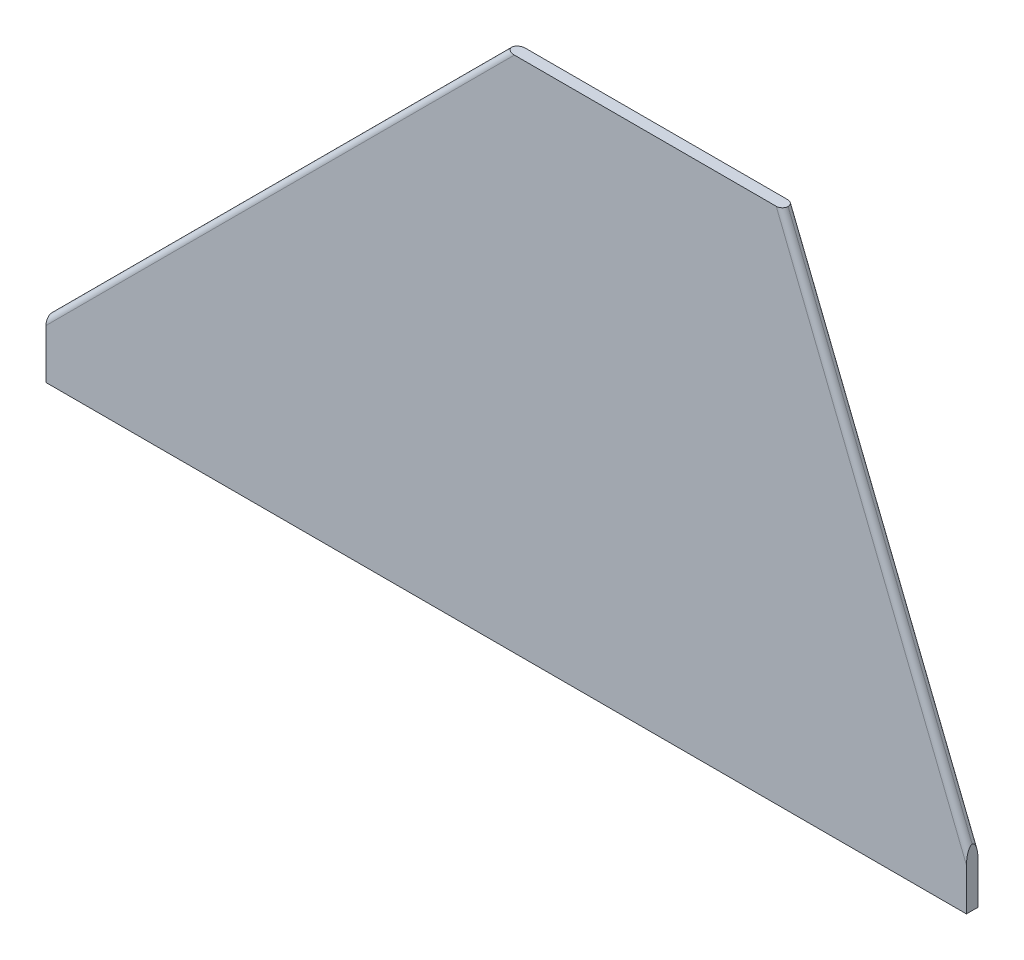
ISO-10303-21;
HEADER;
FILE_DESCRIPTION(('STEP AP214'),'2;1');
FILE_NAME('part.step','',(''),(''),'','','');
FILE_SCHEMA(('AUTOMOTIVE_DESIGN { 1 0 10303 214 1 1 1 1 }'));
ENDSEC;
DATA;
#1=APPLICATION_CONTEXT('core data for automotive mechanical design processes');
#2=APPLICATION_PROTOCOL_DEFINITION('international standard','automotive_design',2000,#1);
#3=PRODUCT_CONTEXT('',#1,'mechanical');
#4=PRODUCT('Part','Part','',(#3));
#5=PRODUCT_RELATED_PRODUCT_CATEGORY('part','',(#4));
#6=PRODUCT_DEFINITION_FORMATION('','',#4);
#7=PRODUCT_DEFINITION_CONTEXT('part definition',#1,'design');
#8=PRODUCT_DEFINITION('design','',#6,#7);
#9=PRODUCT_DEFINITION_SHAPE('','',#8);
#10=(LENGTH_UNIT() NAMED_UNIT(*) SI_UNIT(.MILLI.,.METRE.));
#11=(NAMED_UNIT(*) PLANE_ANGLE_UNIT() SI_UNIT($,.RADIAN.));
#12=(NAMED_UNIT(*) SI_UNIT($,.STERADIAN.) SOLID_ANGLE_UNIT());
#13=UNCERTAINTY_MEASURE_WITH_UNIT(LENGTH_MEASURE(1.E-05),#10,'distance_accuracy_value','');
#14=(GEOMETRIC_REPRESENTATION_CONTEXT(3) GLOBAL_UNCERTAINTY_ASSIGNED_CONTEXT((#13)) GLOBAL_UNIT_ASSIGNED_CONTEXT((#10,
#11,#12)) REPRESENTATION_CONTEXT('',''));
#15=CARTESIAN_POINT('',(0.,0.,0.));
#16=DIRECTION('',(0.,0.,1.));
#17=DIRECTION('',(1.,0.,0.));
#18=AXIS2_PLACEMENT_3D('',#15,#16,#17);
#19=CARTESIAN_POINT('',(-56.9864806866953,0.,1.5875));
#20=DIRECTION('',(1.,0.,0.));
#21=DIRECTION('',(0.,0.,-1.));
#22=AXIS2_PLACEMENT_3D('',#19,#20,#21);
#23=PLANE('',#22);
#24=DIRECTION('',(0.,-1.,0.));
#25=VECTOR('',#24,1.);
#26=CARTESIAN_POINT('',(-56.9864806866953,0.,0.));
#27=LINE('',#26,#25);
#28=CARTESIAN_POINT('',(-56.9864806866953,-1.12253201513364,0.));
#29=VERTEX_POINT('',#28);
#30=CARTESIAN_POINT('',(-56.9864806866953,-7.9375,0.));
#31=VERTEX_POINT('',#30);
#32=EDGE_CURVE('E114',#29,#31,#27,.T.);
#33=ORIENTED_EDGE('',*,*,#32,.T.);
#34=CARTESIAN_POINT('',(-56.9864806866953,-28.5597299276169,0.79375));
#35=DIRECTION('',(1.,0.,0.));
#36=DIRECTION('',(0.,0.,-1.));
#37=AXIS2_PLACEMENT_3D('',#34,#35,#36);
#38=CIRCLE('',#37,20.6375);
#39=CARTESIAN_POINT('',(-56.9864806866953,-7.9375,1.5875));
#40=VERTEX_POINT('',#39);
#41=EDGE_CURVE('E45',#31,#40,#38,.T.);
#42=ORIENTED_EDGE('',*,*,#41,.T.);
#43=DIRECTION('',(0.,-1.,0.));
#44=VECTOR('',#43,1.);
#45=CARTESIAN_POINT('',(-56.9864806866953,0.,1.5875));
#46=LINE('',#45,#44);
#47=CARTESIAN_POINT('',(-56.9864806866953,-1.12253201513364,1.5875));
#48=VERTEX_POINT('',#47);
#49=EDGE_CURVE('E117',#48,#40,#46,.T.);
#50=ORIENTED_EDGE('',*,*,#49,.F.);
#51=CARTESIAN_POINT('',(-56.9864806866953,-1.12253201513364,0.79375));
#52=DIRECTION('',(1.,0.,0.));
#53=DIRECTION('',(0.,1.,0.));
#54=AXIS2_PLACEMENT_3D('',#51,#52,#53);
#55=ELLIPSE('',#54,1.12253201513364,0.79375);
#56=CARTESIAN_POINT('',(-56.9864806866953,0.,0.79375));
#57=VERTEX_POINT('',#56);
#58=EDGE_CURVE('E52',#48,#57,#55,.F.);
#59=ORIENTED_EDGE('',*,*,#58,.T.);
#60=CARTESIAN_POINT('',(-56.9864806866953,-1.12253201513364,0.79375));
#61=DIRECTION('',(1.,0.,0.));
#62=DIRECTION('',(0.,-1.,0.));
#63=AXIS2_PLACEMENT_3D('',#60,#61,#62);
#64=ELLIPSE('',#63,1.12253201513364,0.79375);
#65=EDGE_CURVE('E38',#57,#29,#64,.F.);
#66=ORIENTED_EDGE('',*,*,#65,.T.);
#67=EDGE_LOOP('',(#33,#42,#50,#59,#66));
#68=FACE_BOUND('',#67,.T.);
#69=ADVANCED_FACE('F31',(#68),#23,.F.);
#70=CARTESIAN_POINT('',(70.0135193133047,0.,1.5875));
#71=DIRECTION('',(-1.,0.,0.));
#72=DIRECTION('',(0.,0.,1.));
#73=AXIS2_PLACEMENT_3D('',#70,#71,#72);
#74=PLANE('',#73);
#75=DIRECTION('',(0.,1.,0.));
#76=VECTOR('',#75,1.);
#77=CARTESIAN_POINT('',(70.0135193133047,0.,1.5875));
#78=LINE('',#77,#76);
#79=CARTESIAN_POINT('',(70.0135193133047,-7.9375,1.5875));
#80=VERTEX_POINT('',#79);
#81=CARTESIAN_POINT('',(70.0135193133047,-2.13723728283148,1.5875));
#82=VERTEX_POINT('',#81);
#83=EDGE_CURVE('E106',#80,#82,#78,.T.);
#84=ORIENTED_EDGE('',*,*,#83,.F.);
#85=CARTESIAN_POINT('',(70.0135193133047,-28.5597299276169,0.79375));
#86=DIRECTION('',(1.,0.,0.));
#87=DIRECTION('',(0.,0.,-1.));
#88=AXIS2_PLACEMENT_3D('',#85,#86,#87);
#89=CIRCLE('',#88,20.6375);
#90=CARTESIAN_POINT('',(70.0135193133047,-7.9375,0.));
#91=VERTEX_POINT('',#90);
#92=EDGE_CURVE('E94',#91,#80,#89,.T.);
#93=ORIENTED_EDGE('',*,*,#92,.F.);
#94=DIRECTION('',(0.,1.,0.));
#95=VECTOR('',#94,1.);
#96=CARTESIAN_POINT('',(70.0135193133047,0.,0.));
#97=LINE('',#96,#95);
#98=CARTESIAN_POINT('',(70.0135193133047,-2.13723728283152,0.));
#99=VERTEX_POINT('',#98);
#100=EDGE_CURVE('E103',#91,#99,#97,.T.);
#101=ORIENTED_EDGE('',*,*,#100,.T.);
#102=CARTESIAN_POINT('',(70.0135193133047,-2.13723728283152,0.79375));
#103=DIRECTION('',(-1.,0.,0.));
#104=DIRECTION('',(0.,1.,0.));
#105=AXIS2_PLACEMENT_3D('',#102,#103,#104);
#106=ELLIPSE('',#105,2.13723728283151,0.79375);
#107=CARTESIAN_POINT('',(70.0135193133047,0.,0.79375));
#108=VERTEX_POINT('',#107);
#109=EDGE_CURVE('E142',#99,#108,#106,.F.);
#110=ORIENTED_EDGE('',*,*,#109,.T.);
#111=CARTESIAN_POINT('',(70.0135193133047,-2.13723728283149,0.79375));
#112=DIRECTION('',(-1.,0.,0.));
#113=DIRECTION('',(0.,-1.,0.));
#114=AXIS2_PLACEMENT_3D('',#111,#112,#113);
#115=ELLIPSE('',#114,2.13723728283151,0.79375);
#116=EDGE_CURVE('E144',#108,#82,#115,.F.);
#117=ORIENTED_EDGE('',*,*,#116,.T.);
#118=EDGE_LOOP('',(#84,#93,#101,#110,#117));
#119=FACE_BOUND('',#118,.T.);
#120=ADVANCED_FACE('F102',(#119),#74,.F.);
#121=CARTESIAN_POINT('',(44.6135193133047,63.5,1.5875));
#122=DIRECTION('',(0.,-1.,0.));
#123=DIRECTION('',(0.,0.,-1.));
#124=AXIS2_PLACEMENT_3D('',#121,#122,#123);
#125=PLANE('',#124);
#126=DIRECTION('',(-1.,0.,0.));
#127=VECTOR('',#126,1.);
#128=CARTESIAN_POINT('',(44.6135193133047,63.5,1.5875));
#129=LINE('',#128,#127);
#130=CARTESIAN_POINT('',(43.7586244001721,63.5,1.5875));
#131=VERTEX_POINT('',#130);
#132=CARTESIAN_POINT('',(7.63605132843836,63.5,1.5875));
#133=VERTEX_POINT('',#132);
#134=EDGE_CURVE('E126',#131,#133,#129,.T.);
#135=ORIENTED_EDGE('',*,*,#134,.F.);
#136=CARTESIAN_POINT('',(43.7586244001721,63.5,0.79375));
#137=DIRECTION('',(0.,-1.,0.));
#138=DIRECTION('',(1.,0.,0.));
#139=AXIS2_PLACEMENT_3D('',#136,#137,#138);
#140=ELLIPSE('',#139,0.854894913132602,0.79375);
#141=CARTESIAN_POINT('',(44.6135193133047,63.5,0.79375));
#142=VERTEX_POINT('',#141);
#143=EDGE_CURVE('E140',#131,#142,#140,.F.);
#144=ORIENTED_EDGE('',*,*,#143,.T.);
#145=CARTESIAN_POINT('',(43.7586244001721,63.5,0.79375));
#146=DIRECTION('',(0.,-1.,0.));
#147=DIRECTION('',(-1.,0.,0.));
#148=AXIS2_PLACEMENT_3D('',#145,#146,#147);
#149=ELLIPSE('',#148,0.854894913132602,0.79375);
#150=CARTESIAN_POINT('',(43.7586244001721,63.5,0.));
#151=VERTEX_POINT('',#150);
#152=EDGE_CURVE('E138',#142,#151,#149,.F.);
#153=ORIENTED_EDGE('',*,*,#152,.T.);
#154=DIRECTION('',(-1.,0.,0.));
#155=VECTOR('',#154,1.);
#156=CARTESIAN_POINT('',(44.6135193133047,63.5,0.));
#157=LINE('',#156,#155);
#158=CARTESIAN_POINT('',(7.63605132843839,63.5,0.));
#159=VERTEX_POINT('',#158);
#160=EDGE_CURVE('E113',#151,#159,#157,.T.);
#161=ORIENTED_EDGE('',*,*,#160,.T.);
#162=CARTESIAN_POINT('',(7.63605132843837,63.5,0.79375));
#163=DIRECTION('',(0.,-1.,0.));
#164=DIRECTION('',(-1.,0.,0.));
#165=AXIS2_PLACEMENT_3D('',#162,#163,#164);
#166=ELLIPSE('',#165,1.12253201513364,0.79375);
#167=CARTESIAN_POINT('',(6.51351931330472,63.5,0.79375));
#168=VERTEX_POINT('',#167);
#169=EDGE_CURVE('E136',#159,#168,#166,.F.);
#170=ORIENTED_EDGE('',*,*,#169,.T.);
#171=CARTESIAN_POINT('',(7.63605132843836,63.5,0.79375));
#172=DIRECTION('',(0.,-1.,0.));
#173=DIRECTION('',(1.,0.,0.));
#174=AXIS2_PLACEMENT_3D('',#171,#172,#173);
#175=ELLIPSE('',#174,1.12253201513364,0.79375);
#176=EDGE_CURVE('E134',#168,#133,#175,.F.);
#177=ORIENTED_EDGE('',*,*,#176,.T.);
#178=EDGE_LOOP('',(#135,#144,#153,#161,#170,#177));
#179=FACE_BOUND('',#178,.T.);
#180=ADVANCED_FACE('F159',(#179),#125,.F.);
#181=CARTESIAN_POINT('',(-56.9864806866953,-9.525,1.5875));
#182=DIRECTION('',(0.,0.,1.));
#183=DIRECTION('',(1.,0.,0.));
#184=AXIS2_PLACEMENT_3D('',#181,#182,#183);
#185=PLANE('',#184);
#186=DIRECTION('',(1.,0.,0.));
#187=VECTOR('',#186,1.);
#188=CARTESIAN_POINT('',(-56.9864806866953,-7.9375,1.5875));
#189=LINE('',#188,#187);
#190=EDGE_CURVE('E165',#80,#40,#189,.F.);
#191=ORIENTED_EDGE('',*,*,#190,.F.);
#192=ORIENTED_EDGE('',*,*,#83,.T.);
#193=DIRECTION('',(-0.371390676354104,0.928476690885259,0.));
#194=VECTOR('',#193,1.);
#195=CARTESIAN_POINT('',(43.8765409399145,63.2052086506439,1.5875));
#196=LINE('',#195,#194);
#197=EDGE_CURVE('E131',#82,#131,#196,.T.);
#198=ORIENTED_EDGE('',*,*,#197,.T.);
#199=ORIENTED_EDGE('',*,*,#134,.T.);
#200=DIRECTION('',(-0.707106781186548,-0.707106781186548,0.));
#201=VECTOR('',#200,1.);
#202=CARTESIAN_POINT('',(-56.4252146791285,-0.561266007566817,1.5875));
#203=LINE('',#202,#201);
#204=EDGE_CURVE('E129',#133,#48,#203,.T.);
#205=ORIENTED_EDGE('',*,*,#204,.T.);
#206=ORIENTED_EDGE('',*,*,#49,.T.);
#207=EDGE_LOOP('',(#191,#192,#198,#199,#205,#206));
#208=FACE_BOUND('',#207,.T.);
#209=ADVANCED_FACE('F164',(#208),#185,.T.);
#210=CARTESIAN_POINT('',(-56.9864806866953,-9.525,0.));
#211=DIRECTION('',(0.,0.,1.));
#212=DIRECTION('',(1.,0.,0.));
#213=AXIS2_PLACEMENT_3D('',#210,#211,#212);
#214=PLANE('',#213);
#215=ORIENTED_EDGE('',*,*,#100,.F.);
#216=DIRECTION('',(1.,0.,0.));
#217=VECTOR('',#216,1.);
#218=CARTESIAN_POINT('',(-56.9864806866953,-7.9375,0.));
#219=LINE('',#218,#217);
#220=EDGE_CURVE('E11',#91,#31,#219,.F.);
#221=ORIENTED_EDGE('',*,*,#220,.T.);
#222=ORIENTED_EDGE('',*,*,#32,.F.);
#223=DIRECTION('',(-0.707106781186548,-0.707106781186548,0.));
#224=VECTOR('',#223,1.);
#225=CARTESIAN_POINT('',(-61.1877146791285,-5.32376600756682,0.));
#226=LINE('',#225,#224);
#227=EDGE_CURVE('E146',#29,#159,#226,.F.);
#228=ORIENTED_EDGE('',*,*,#227,.T.);
#229=ORIENTED_EDGE('',*,*,#160,.F.);
#230=DIRECTION('',(-0.371390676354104,0.928476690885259,0.));
#231=VECTOR('',#230,1.);
#232=CARTESIAN_POINT('',(55.0437823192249,35.2871052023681,0.));
#233=LINE('',#232,#231);
#234=EDGE_CURVE('E111',#151,#99,#233,.F.);
#235=ORIENTED_EDGE('',*,*,#234,.T.);
#236=EDGE_LOOP('',(#215,#221,#222,#228,#229,#235));
#237=FACE_BOUND('',#236,.T.);
#238=ADVANCED_FACE('F108',(#237),#214,.F.);
#239=CARTESIAN_POINT('',(69.2765409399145,-0.29479134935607,0.79375));
#240=DIRECTION('',(-0.371390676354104,0.928476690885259,0.));
#241=DIRECTION('',(-0.928476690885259,-0.371390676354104,0.));
#242=AXIS2_PLACEMENT_3D('',#239,#240,#241);
#243=CYLINDRICAL_SURFACE('',#242,0.79375);
#244=DIRECTION('',(-0.371390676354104,0.928476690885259,0.));
#245=VECTOR('',#244,1.);
#246=CARTESIAN_POINT('',(70.0135193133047,0.,0.79375));
#247=LINE('',#246,#245);
#248=EDGE_CURVE('E119',#108,#142,#247,.T.);
#249=ORIENTED_EDGE('',*,*,#248,.F.);
#250=ORIENTED_EDGE('',*,*,#109,.F.);
#251=ORIENTED_EDGE('',*,*,#234,.F.);
#252=ORIENTED_EDGE('',*,*,#152,.F.);
#253=EDGE_LOOP('',(#249,#250,#251,#252));
#254=FACE_BOUND('',#253,.T.);
#255=ADVANCED_FACE('F177',(#254),#243,.T.);
#256=CARTESIAN_POINT('',(55.0437823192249,35.2871052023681,0.79375));
#257=DIRECTION('',(0.371390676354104,-0.928476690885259,0.));
#258=DIRECTION('',(0.928476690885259,0.371390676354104,0.));
#259=AXIS2_PLACEMENT_3D('',#256,#257,#258);
#260=CYLINDRICAL_SURFACE('',#259,0.79375);
#261=ORIENTED_EDGE('',*,*,#116,.F.);
#262=ORIENTED_EDGE('',*,*,#248,.T.);
#263=ORIENTED_EDGE('',*,*,#143,.F.);
#264=ORIENTED_EDGE('',*,*,#197,.F.);
#265=EDGE_LOOP('',(#261,#262,#263,#264));
#266=FACE_BOUND('',#265,.T.);
#267=ADVANCED_FACE('F173',(#266),#260,.T.);
#268=CARTESIAN_POINT('',(-61.1877146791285,-5.32376600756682,0.79375));
#269=DIRECTION('',(0.707106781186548,0.707106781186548,0.));
#270=DIRECTION('',(-0.707106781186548,0.707106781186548,0.));
#271=AXIS2_PLACEMENT_3D('',#268,#269,#270);
#272=CYLINDRICAL_SURFACE('',#271,0.79375);
#273=ORIENTED_EDGE('',*,*,#204,.F.);
#274=ORIENTED_EDGE('',*,*,#176,.F.);
#275=DIRECTION('',(-0.707106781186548,-0.707106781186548,0.));
#276=VECTOR('',#275,1.);
#277=CARTESIAN_POINT('',(6.51351931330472,63.5,0.79375));
#278=LINE('',#277,#276);
#279=EDGE_CURVE('E155',#57,#168,#278,.F.);
#280=ORIENTED_EDGE('',*,*,#279,.F.);
#281=ORIENTED_EDGE('',*,*,#58,.F.);
#282=EDGE_LOOP('',(#273,#274,#280,#281));
#283=FACE_BOUND('',#282,.T.);
#284=ADVANCED_FACE('F162',(#283),#272,.T.);
#285=CARTESIAN_POINT('',(7.07478532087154,62.9387339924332,0.79375));
#286=DIRECTION('',(-0.707106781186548,-0.707106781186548,0.));
#287=DIRECTION('',(0.707106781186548,-0.707106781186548,0.));
#288=AXIS2_PLACEMENT_3D('',#285,#286,#287);
#289=CYLINDRICAL_SURFACE('',#288,0.79375);
#290=ORIENTED_EDGE('',*,*,#169,.F.);
#291=ORIENTED_EDGE('',*,*,#227,.F.);
#292=ORIENTED_EDGE('',*,*,#65,.F.);
#293=ORIENTED_EDGE('',*,*,#279,.T.);
#294=EDGE_LOOP('',(#290,#291,#292,#293));
#295=FACE_BOUND('',#294,.T.);
#296=ADVANCED_FACE('F154',(#295),#289,.T.);
#297=CARTESIAN_POINT('',(-56.9864806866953,-28.5597299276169,0.79375));
#298=DIRECTION('',(1.,0.,0.));
#299=DIRECTION('',(0.,0.,-1.));
#300=AXIS2_PLACEMENT_3D('',#297,#298,#299);
#301=CYLINDRICAL_SURFACE('',#300,20.6375);
#302=ORIENTED_EDGE('',*,*,#190,.T.);
#303=ORIENTED_EDGE('',*,*,#41,.F.);
#304=ORIENTED_EDGE('',*,*,#220,.F.);
#305=ORIENTED_EDGE('',*,*,#92,.T.);
#306=EDGE_LOOP('',(#302,#303,#304,#305));
#307=FACE_BOUND('',#306,.T.);
#308=ADVANCED_FACE('F93',(#307),#301,.F.);
#309=CLOSED_SHELL('',(#69,#120,#180,#209,#238,#255,#267,#284,#296,#308));
#310=MANIFOLD_SOLID_BREP('B2',#309);
#311=ADVANCED_BREP_SHAPE_REPRESENTATION('',(#18,#310),#14);
#312=SHAPE_DEFINITION_REPRESENTATION(#9,#311);
ENDSEC;
END-ISO-10303-21;
